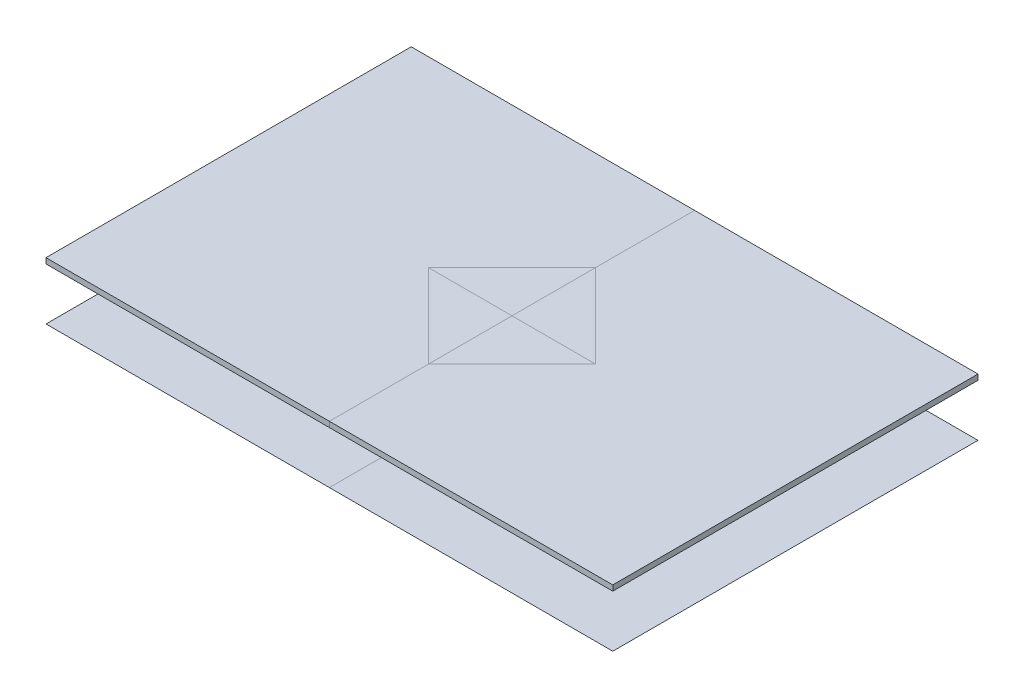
ISO-10303-21;
HEADER;
FILE_DESCRIPTION(('STEP AP214'),'2;1');
FILE_NAME('part.step','',(''),(''),'','','');
FILE_SCHEMA(('AUTOMOTIVE_DESIGN { 1 0 10303 214 1 1 1 1 }'));
ENDSEC;
DATA;
#1=APPLICATION_CONTEXT('core data for automotive mechanical design processes');
#2=APPLICATION_PROTOCOL_DEFINITION('international standard','automotive_design',2000,#1);
#3=PRODUCT_CONTEXT('',#1,'mechanical');
#4=PRODUCT('Part','Part','',(#3));
#5=PRODUCT_RELATED_PRODUCT_CATEGORY('part','',(#4));
#6=PRODUCT_DEFINITION_FORMATION('','',#4);
#7=PRODUCT_DEFINITION_CONTEXT('part definition',#1,'design');
#8=PRODUCT_DEFINITION('design','',#6,#7);
#9=PRODUCT_DEFINITION_SHAPE('','',#8);
#10=(LENGTH_UNIT() NAMED_UNIT(*) SI_UNIT(.MILLI.,.METRE.));
#11=(NAMED_UNIT(*) PLANE_ANGLE_UNIT() SI_UNIT($,.RADIAN.));
#12=(NAMED_UNIT(*) SI_UNIT($,.STERADIAN.) SOLID_ANGLE_UNIT());
#13=UNCERTAINTY_MEASURE_WITH_UNIT(LENGTH_MEASURE(1.E-05),#10,'distance_accuracy_value','');
#14=(GEOMETRIC_REPRESENTATION_CONTEXT(3) GLOBAL_UNCERTAINTY_ASSIGNED_CONTEXT((#13)) GLOBAL_UNIT_ASSIGNED_CONTEXT((#10,
#11,#12)) REPRESENTATION_CONTEXT('',''));
#15=CARTESIAN_POINT('',(0.,0.,0.));
#16=DIRECTION('',(0.,0.,1.));
#17=DIRECTION('',(1.,0.,0.));
#18=AXIS2_PLACEMENT_3D('',#15,#16,#17);
#19=CARTESIAN_POINT('',(0.,10.,0.));
#20=DIRECTION('',(-1.,0.,0.));
#21=DIRECTION('',(0.,0.,1.));
#22=AXIS2_PLACEMENT_3D('',#19,#20,#21);
#23=PLANE('',#22);
#24=DIRECTION('',(0.,1.,0.));
#25=VECTOR('',#24,1.);
#26=CARTESIAN_POINT('',(0.,10.,-15.2356445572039));
#27=LINE('',#26,#25);
#28=CARTESIAN_POINT('',(0.,9.5,-15.2356445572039));
#29=VERTEX_POINT('',#28);
#30=CARTESIAN_POINT('',(0.,10.5,-15.2356445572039));
#31=VERTEX_POINT('',#30);
#32=EDGE_CURVE('E12',#29,#31,#27,.T.);
#33=ORIENTED_EDGE('',*,*,#32,.F.);
#34=DIRECTION('',(0.,0.,1.));
#35=VECTOR('',#34,1.);
#36=CARTESIAN_POINT('',(0.,9.5,0.));
#37=LINE('',#36,#35);
#38=CARTESIAN_POINT('',(0.,9.5,-33.382140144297));
#39=VERTEX_POINT('',#38);
#40=EDGE_CURVE('E119',#29,#39,#37,.F.);
#41=ORIENTED_EDGE('',*,*,#40,.T.);
#42=DIRECTION('',(0.,1.,0.));
#43=VECTOR('',#42,1.);
#44=CARTESIAN_POINT('',(0.,10.,-33.382140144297));
#45=LINE('',#44,#43);
#46=CARTESIAN_POINT('',(0.,10.5,-33.382140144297));
#47=VERTEX_POINT('',#46);
#48=EDGE_CURVE('E55',#39,#47,#45,.T.);
#49=ORIENTED_EDGE('',*,*,#48,.T.);
#50=DIRECTION('',(0.,0.,1.));
#51=VECTOR('',#50,1.);
#52=CARTESIAN_POINT('',(0.,10.5,0.));
#53=LINE('',#52,#51);
#54=EDGE_CURVE('E147',#31,#47,#53,.F.);
#55=ORIENTED_EDGE('',*,*,#54,.F.);
#56=EDGE_LOOP('',(#33,#41,#49,#55));
#57=FACE_BOUND('',#56,.T.);
#58=ADVANCED_FACE('F45',(#57),#23,.F.);
#59=CARTESIAN_POINT('',(0.,10.,-33.382140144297));
#60=DIRECTION('',(0.,0.,1.));
#61=DIRECTION('',(1.,0.,0.));
#62=AXIS2_PLACEMENT_3D('',#59,#60,#61);
#63=PLANE('',#62);
#64=ORIENTED_EDGE('',*,*,#48,.F.);
#65=DIRECTION('',(1.,0.,0.));
#66=VECTOR('',#65,1.);
#67=CARTESIAN_POINT('',(0.,9.5,-33.382140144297));
#68=LINE('',#67,#66);
#69=CARTESIAN_POINT('',(-51.8038208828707,9.5,-33.382140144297));
#70=VERTEX_POINT('',#69);
#71=EDGE_CURVE('E135',#39,#70,#68,.F.);
#72=ORIENTED_EDGE('',*,*,#71,.T.);
#73=DIRECTION('',(0.,1.,0.));
#74=VECTOR('',#73,1.);
#75=CARTESIAN_POINT('',(-51.8038208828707,10.,-33.382140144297));
#76=LINE('',#75,#74);
#77=CARTESIAN_POINT('',(-51.8038208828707,10.5,-33.382140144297));
#78=VERTEX_POINT('',#77);
#79=EDGE_CURVE('E144',#70,#78,#76,.T.);
#80=ORIENTED_EDGE('',*,*,#79,.T.);
#81=DIRECTION('',(1.,0.,0.));
#82=VECTOR('',#81,1.);
#83=CARTESIAN_POINT('',(0.,10.5,-33.382140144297));
#84=LINE('',#83,#82);
#85=EDGE_CURVE('E154',#47,#78,#84,.F.);
#86=ORIENTED_EDGE('',*,*,#85,.F.);
#87=EDGE_LOOP('',(#64,#72,#80,#86));
#88=FACE_BOUND('',#87,.T.);
#89=ADVANCED_FACE('F156',(#88),#63,.F.);
#90=CARTESIAN_POINT('',(-51.8038208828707,10.,0.));
#91=DIRECTION('',(-1.,0.,0.));
#92=DIRECTION('',(0.,0.,1.));
#93=AXIS2_PLACEMENT_3D('',#90,#91,#92);
#94=PLANE('',#93);
#95=ORIENTED_EDGE('',*,*,#79,.F.);
#96=DIRECTION('',(0.,0.,1.));
#97=VECTOR('',#96,1.);
#98=CARTESIAN_POINT('',(-51.8038208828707,9.5,0.));
#99=LINE('',#98,#97);
#100=CARTESIAN_POINT('',(-51.8038208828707,9.5,33.382140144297));
#101=VERTEX_POINT('',#100);
#102=EDGE_CURVE('E132',#70,#101,#99,.T.);
#103=ORIENTED_EDGE('',*,*,#102,.T.);
#104=DIRECTION('',(0.,1.,0.));
#105=VECTOR('',#104,1.);
#106=CARTESIAN_POINT('',(-51.8038208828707,10.,33.382140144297));
#107=LINE('',#106,#105);
#108=CARTESIAN_POINT('',(-51.8038208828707,10.5,33.382140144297));
#109=VERTEX_POINT('',#108);
#110=EDGE_CURVE('E142',#101,#109,#107,.T.);
#111=ORIENTED_EDGE('',*,*,#110,.T.);
#112=DIRECTION('',(0.,0.,1.));
#113=VECTOR('',#112,1.);
#114=CARTESIAN_POINT('',(-51.8038208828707,10.5,0.));
#115=LINE('',#114,#113);
#116=EDGE_CURVE('E157',#78,#109,#115,.T.);
#117=ORIENTED_EDGE('',*,*,#116,.F.);
#118=EDGE_LOOP('',(#95,#103,#111,#117));
#119=FACE_BOUND('',#118,.T.);
#120=ADVANCED_FACE('F173',(#119),#94,.T.);
#121=CARTESIAN_POINT('',(0.,10.,33.382140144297));
#122=DIRECTION('',(0.,0.,1.));
#123=DIRECTION('',(1.,0.,0.));
#124=AXIS2_PLACEMENT_3D('',#121,#122,#123);
#125=PLANE('',#124);
#126=ORIENTED_EDGE('',*,*,#110,.F.);
#127=DIRECTION('',(1.,0.,0.));
#128=VECTOR('',#127,1.);
#129=CARTESIAN_POINT('',(0.,9.5,33.382140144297));
#130=LINE('',#129,#128);
#131=CARTESIAN_POINT('',(0.,9.5,33.382140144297));
#132=VERTEX_POINT('',#131);
#133=EDGE_CURVE('E129',#101,#132,#130,.T.);
#134=ORIENTED_EDGE('',*,*,#133,.T.);
#135=DIRECTION('',(0.,1.,0.));
#136=VECTOR('',#135,1.);
#137=CARTESIAN_POINT('',(0.,10.,33.382140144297));
#138=LINE('',#137,#136);
#139=CARTESIAN_POINT('',(0.,10.5,33.382140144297));
#140=VERTEX_POINT('',#139);
#141=EDGE_CURVE('E140',#132,#140,#138,.T.);
#142=ORIENTED_EDGE('',*,*,#141,.T.);
#143=DIRECTION('',(1.,0.,0.));
#144=VECTOR('',#143,1.);
#145=CARTESIAN_POINT('',(0.,10.5,33.382140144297));
#146=LINE('',#145,#144);
#147=EDGE_CURVE('E159',#109,#140,#146,.T.);
#148=ORIENTED_EDGE('',*,*,#147,.F.);
#149=EDGE_LOOP('',(#126,#134,#142,#148));
#150=FACE_BOUND('',#149,.T.);
#151=ADVANCED_FACE('F170',(#150),#125,.T.);
#152=CARTESIAN_POINT('',(0.,10.,0.));
#153=DIRECTION('',(-1.,0.,0.));
#154=DIRECTION('',(0.,0.,1.));
#155=AXIS2_PLACEMENT_3D('',#152,#153,#154);
#156=PLANE('',#155);
#157=ORIENTED_EDGE('',*,*,#141,.F.);
#158=DIRECTION('',(0.,0.,1.));
#159=VECTOR('',#158,1.);
#160=CARTESIAN_POINT('',(0.,9.5,0.));
#161=LINE('',#160,#159);
#162=CARTESIAN_POINT('',(0.,9.5,15.2356445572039));
#163=VERTEX_POINT('',#162);
#164=EDGE_CURVE('E126',#132,#163,#161,.F.);
#165=ORIENTED_EDGE('',*,*,#164,.T.);
#166=DIRECTION('',(0.,1.,0.));
#167=VECTOR('',#166,1.);
#168=CARTESIAN_POINT('',(0.,10.,15.2356445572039));
#169=LINE('',#168,#167);
#170=CARTESIAN_POINT('',(0.,10.5,15.2356445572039));
#171=VERTEX_POINT('',#170);
#172=EDGE_CURVE('E63',#163,#171,#169,.T.);
#173=ORIENTED_EDGE('',*,*,#172,.T.);
#174=DIRECTION('',(0.,0.,1.));
#175=VECTOR('',#174,1.);
#176=CARTESIAN_POINT('',(0.,10.5,0.));
#177=LINE('',#176,#175);
#178=EDGE_CURVE('E112',#140,#171,#177,.F.);
#179=ORIENTED_EDGE('',*,*,#178,.F.);
#180=EDGE_LOOP('',(#157,#165,#173,#179));
#181=FACE_BOUND('',#180,.T.);
#182=ADVANCED_FACE('F167',(#181),#156,.F.);
#183=CARTESIAN_POINT('',(-7.61782227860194,10.,7.61782227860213));
#184=DIRECTION('',(0.707106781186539,0.,-0.707106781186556));
#185=DIRECTION('',(-0.707106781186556,0.,-0.707106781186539));
#186=AXIS2_PLACEMENT_3D('',#183,#184,#185);
#187=PLANE('',#186);
#188=ORIENTED_EDGE('',*,*,#172,.F.);
#189=DIRECTION('',(-0.707106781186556,0.,-0.707106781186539));
#190=VECTOR('',#189,1.);
#191=CARTESIAN_POINT('',(-7.61782227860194,9.5,7.61782227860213));
#192=LINE('',#191,#190);
#193=CARTESIAN_POINT('',(-15.2356445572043,9.5,0.));
#194=VERTEX_POINT('',#193);
#195=EDGE_CURVE('E117',#163,#194,#192,.T.);
#196=ORIENTED_EDGE('',*,*,#195,.T.);
#197=DIRECTION('',(0.,1.,0.));
#198=VECTOR('',#197,1.);
#199=CARTESIAN_POINT('',(-15.2356445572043,10.,0.));
#200=LINE('',#199,#198);
#201=CARTESIAN_POINT('',(-15.2356445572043,10.5,0.));
#202=VERTEX_POINT('',#201);
#203=EDGE_CURVE('E49',#194,#202,#200,.T.);
#204=ORIENTED_EDGE('',*,*,#203,.T.);
#205=DIRECTION('',(-0.707106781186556,0.,-0.707106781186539));
#206=VECTOR('',#205,1.);
#207=CARTESIAN_POINT('',(-7.61782227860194,10.5,7.61782227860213));
#208=LINE('',#207,#206);
#209=EDGE_CURVE('E128',#171,#202,#208,.T.);
#210=ORIENTED_EDGE('',*,*,#209,.F.);
#211=EDGE_LOOP('',(#188,#196,#204,#210));
#212=FACE_BOUND('',#211,.T.);
#213=ADVANCED_FACE('F121',(#212),#187,.T.);
#214=CARTESIAN_POINT('',(-7.61782227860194,10.,-7.61782227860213));
#215=DIRECTION('',(0.707106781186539,0.,0.707106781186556));
#216=DIRECTION('',(0.707106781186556,0.,-0.707106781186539));
#217=AXIS2_PLACEMENT_3D('',#214,#215,#216);
#218=PLANE('',#217);
#219=DIRECTION('',(0.707106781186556,0.,-0.707106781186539));
#220=VECTOR('',#219,1.);
#221=CARTESIAN_POINT('',(-7.61782227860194,9.5,-7.61782227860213));
#222=LINE('',#221,#220);
#223=EDGE_CURVE('E106',#194,#29,#222,.T.);
#224=ORIENTED_EDGE('',*,*,#223,.T.);
#225=ORIENTED_EDGE('',*,*,#32,.T.);
#226=DIRECTION('',(0.707106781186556,0.,-0.707106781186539));
#227=VECTOR('',#226,1.);
#228=CARTESIAN_POINT('',(-7.61782227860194,10.5,-7.61782227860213));
#229=LINE('',#228,#227);
#230=EDGE_CURVE('E108',#202,#31,#229,.T.);
#231=ORIENTED_EDGE('',*,*,#230,.F.);
#232=ORIENTED_EDGE('',*,*,#203,.F.);
#233=EDGE_LOOP('',(#224,#225,#231,#232));
#234=FACE_BOUND('',#233,.T.);
#235=ADVANCED_FACE('F47',(#234),#218,.T.);
#236=CARTESIAN_POINT('',(0.,10.5,0.));
#237=DIRECTION('',(0.,1.,0.));
#238=DIRECTION('',(0.,0.,1.));
#239=AXIS2_PLACEMENT_3D('',#236,#237,#238);
#240=PLANE('',#239);
#241=ORIENTED_EDGE('',*,*,#209,.T.);
#242=ORIENTED_EDGE('',*,*,#230,.T.);
#243=ORIENTED_EDGE('',*,*,#54,.T.);
#244=ORIENTED_EDGE('',*,*,#85,.T.);
#245=ORIENTED_EDGE('',*,*,#116,.T.);
#246=ORIENTED_EDGE('',*,*,#147,.T.);
#247=ORIENTED_EDGE('',*,*,#178,.T.);
#248=EDGE_LOOP('',(#241,#242,#243,#244,#245,#246,#247));
#249=FACE_BOUND('',#248,.T.);
#250=ADVANCED_FACE('F152',(#249),#240,.T.);
#251=CARTESIAN_POINT('',(0.,9.5,0.));
#252=DIRECTION('',(0.,1.,0.));
#253=DIRECTION('',(0.,0.,1.));
#254=AXIS2_PLACEMENT_3D('',#251,#252,#253);
#255=PLANE('',#254);
#256=ORIENTED_EDGE('',*,*,#195,.F.);
#257=ORIENTED_EDGE('',*,*,#164,.F.);
#258=ORIENTED_EDGE('',*,*,#133,.F.);
#259=ORIENTED_EDGE('',*,*,#102,.F.);
#260=ORIENTED_EDGE('',*,*,#71,.F.);
#261=ORIENTED_EDGE('',*,*,#40,.F.);
#262=ORIENTED_EDGE('',*,*,#223,.F.);
#263=EDGE_LOOP('',(#256,#257,#258,#259,#260,#261,#262));
#264=FACE_BOUND('',#263,.T.);
#265=ADVANCED_FACE('F115',(#264),#255,.F.);
#266=CLOSED_SHELL('',(#58,#89,#120,#151,#182,#213,#235,#250,#265));
#267=MANIFOLD_SOLID_BREP('B2',#266);
#268=CARTESIAN_POINT('',(-7.61782227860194,10.,7.61782227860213));
#269=DIRECTION('',(0.707106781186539,0.,-0.707106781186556));
#270=DIRECTION('',(-0.707106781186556,0.,-0.707106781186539));
#271=AXIS2_PLACEMENT_3D('',#268,#269,#270);
#272=PLANE('',#271);
#273=DIRECTION('',(0.,1.,0.));
#274=VECTOR('',#273,1.);
#275=CARTESIAN_POINT('',(-15.2356445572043,10.,0.));
#276=LINE('',#275,#274);
#277=CARTESIAN_POINT('',(-15.2356445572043,9.5,0.));
#278=VERTEX_POINT('',#277);
#279=CARTESIAN_POINT('',(-15.2356445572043,10.5,0.));
#280=VERTEX_POINT('',#279);
#281=EDGE_CURVE('E43',#278,#280,#276,.T.);
#282=ORIENTED_EDGE('',*,*,#281,.F.);
#283=DIRECTION('',(-0.707106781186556,0.,-0.707106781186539));
#284=VECTOR('',#283,1.);
#285=CARTESIAN_POINT('',(-7.61782227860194,9.5,7.61782227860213));
#286=LINE('',#285,#284);
#287=CARTESIAN_POINT('',(0.,9.5,15.2356445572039));
#288=VERTEX_POINT('',#287);
#289=EDGE_CURVE('E300',#288,#278,#286,.T.);
#290=ORIENTED_EDGE('',*,*,#289,.F.);
#291=DIRECTION('',(0.,1.,0.));
#292=VECTOR('',#291,1.);
#293=CARTESIAN_POINT('',(0.,10.,15.2356445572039));
#294=LINE('',#293,#292);
#295=CARTESIAN_POINT('',(0.,10.5,15.2356445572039));
#296=VERTEX_POINT('',#295);
#297=EDGE_CURVE('E266',#288,#296,#294,.T.);
#298=ORIENTED_EDGE('',*,*,#297,.T.);
#299=DIRECTION('',(-0.707106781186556,0.,-0.707106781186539));
#300=VECTOR('',#299,1.);
#301=CARTESIAN_POINT('',(-7.61782227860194,10.5,7.61782227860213));
#302=LINE('',#301,#300);
#303=EDGE_CURVE('E295',#296,#280,#302,.T.);
#304=ORIENTED_EDGE('',*,*,#303,.T.);
#305=EDGE_LOOP('',(#282,#290,#298,#304));
#306=FACE_BOUND('',#305,.T.);
#307=ADVANCED_FACE('F256',(#306),#272,.F.);
#308=CARTESIAN_POINT('',(0.,10.,0.));
#309=DIRECTION('',(-1.,0.,0.));
#310=DIRECTION('',(0.,0.,1.));
#311=AXIS2_PLACEMENT_3D('',#308,#309,#310);
#312=PLANE('',#311);
#313=ORIENTED_EDGE('',*,*,#297,.F.);
#314=DIRECTION('',(0.,0.,1.));
#315=VECTOR('',#314,1.);
#316=CARTESIAN_POINT('',(0.,9.5,0.));
#317=LINE('',#316,#315);
#318=CARTESIAN_POINT('',(0.,9.5,0.));
#319=VERTEX_POINT('',#318);
#320=EDGE_CURVE('E299',#288,#319,#317,.F.);
#321=ORIENTED_EDGE('',*,*,#320,.T.);
#322=DIRECTION('',(0.,1.,0.));
#323=VECTOR('',#322,1.);
#324=CARTESIAN_POINT('',(0.,10.,0.));
#325=LINE('',#324,#323);
#326=CARTESIAN_POINT('',(0.,10.5,0.));
#327=VERTEX_POINT('',#326);
#328=EDGE_CURVE('E260',#319,#327,#325,.T.);
#329=ORIENTED_EDGE('',*,*,#328,.T.);
#330=DIRECTION('',(0.,0.,1.));
#331=VECTOR('',#330,1.);
#332=CARTESIAN_POINT('',(0.,10.5,0.));
#333=LINE('',#332,#331);
#334=EDGE_CURVE('E307',#296,#327,#333,.F.);
#335=ORIENTED_EDGE('',*,*,#334,.F.);
#336=EDGE_LOOP('',(#313,#321,#329,#335));
#337=FACE_BOUND('',#336,.T.);
#338=ADVANCED_FACE('F302',(#337),#312,.F.);
#339=CARTESIAN_POINT('',(0.,10.,0.));
#340=DIRECTION('',(0.,0.,1.));
#341=DIRECTION('',(1.,0.,0.));
#342=AXIS2_PLACEMENT_3D('',#339,#340,#341);
#343=PLANE('',#342);
#344=DIRECTION('',(1.,0.,0.));
#345=VECTOR('',#344,1.);
#346=CARTESIAN_POINT('',(0.,9.5,0.));
#347=LINE('',#346,#345);
#348=EDGE_CURVE('E288',#319,#278,#347,.F.);
#349=ORIENTED_EDGE('',*,*,#348,.T.);
#350=ORIENTED_EDGE('',*,*,#281,.T.);
#351=DIRECTION('',(1.,0.,0.));
#352=VECTOR('',#351,1.);
#353=CARTESIAN_POINT('',(0.,10.5,0.));
#354=LINE('',#353,#352);
#355=EDGE_CURVE('E291',#327,#280,#354,.F.);
#356=ORIENTED_EDGE('',*,*,#355,.F.);
#357=ORIENTED_EDGE('',*,*,#328,.F.);
#358=EDGE_LOOP('',(#349,#350,#356,#357));
#359=FACE_BOUND('',#358,.T.);
#360=ADVANCED_FACE('F258',(#359),#343,.F.);
#361=CARTESIAN_POINT('',(0.,10.5,0.));
#362=DIRECTION('',(0.,1.,0.));
#363=DIRECTION('',(0.,0.,1.));
#364=AXIS2_PLACEMENT_3D('',#361,#362,#363);
#365=PLANE('',#364);
#366=ORIENTED_EDGE('',*,*,#334,.T.);
#367=ORIENTED_EDGE('',*,*,#355,.T.);
#368=ORIENTED_EDGE('',*,*,#303,.F.);
#369=EDGE_LOOP('',(#366,#367,#368));
#370=FACE_BOUND('',#369,.T.);
#371=ADVANCED_FACE('F312',(#370),#365,.T.);
#372=CARTESIAN_POINT('',(0.,9.5,0.));
#373=DIRECTION('',(0.,1.,0.));
#374=DIRECTION('',(0.,0.,1.));
#375=AXIS2_PLACEMENT_3D('',#372,#373,#374);
#376=PLANE('',#375);
#377=ORIENTED_EDGE('',*,*,#320,.F.);
#378=ORIENTED_EDGE('',*,*,#289,.T.);
#379=ORIENTED_EDGE('',*,*,#348,.F.);
#380=EDGE_LOOP('',(#377,#378,#379));
#381=FACE_BOUND('',#380,.T.);
#382=ADVANCED_FACE('F298',(#381),#376,.F.);
#383=CLOSED_SHELL('',(#307,#338,#360,#371,#382));
#384=MANIFOLD_SOLID_BREP('B6',#383);
#385=CARTESIAN_POINT('',(0.,10.,0.));
#386=DIRECTION('',(-1.,0.,0.));
#387=DIRECTION('',(0.,0.,1.));
#388=AXIS2_PLACEMENT_3D('',#385,#386,#387);
#389=PLANE('',#388);
#390=DIRECTION('',(0.,1.,0.));
#391=VECTOR('',#390,1.);
#392=CARTESIAN_POINT('',(0.,10.,15.2356445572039));
#393=LINE('',#392,#391);
#394=CARTESIAN_POINT('',(0.,9.5,15.2356445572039));
#395=VERTEX_POINT('',#394);
#396=CARTESIAN_POINT('',(0.,10.5,15.2356445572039));
#397=VERTEX_POINT('',#396);
#398=EDGE_CURVE('E254',#395,#397,#393,.T.);
#399=ORIENTED_EDGE('',*,*,#398,.F.);
#400=DIRECTION('',(0.,0.,1.));
#401=VECTOR('',#400,1.);
#402=CARTESIAN_POINT('',(0.,9.5,0.));
#403=LINE('',#402,#401);
#404=CARTESIAN_POINT('',(0.,9.5,33.382140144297));
#405=VERTEX_POINT('',#404);
#406=EDGE_CURVE('E437',#405,#395,#403,.F.);
#407=ORIENTED_EDGE('',*,*,#406,.F.);
#408=DIRECTION('',(0.,1.,0.));
#409=VECTOR('',#408,1.);
#410=CARTESIAN_POINT('',(0.,10.,33.382140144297));
#411=LINE('',#410,#409);
#412=CARTESIAN_POINT('',(0.,10.5,33.382140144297));
#413=VERTEX_POINT('',#412);
#414=EDGE_CURVE('E373',#405,#413,#411,.T.);
#415=ORIENTED_EDGE('',*,*,#414,.T.);
#416=DIRECTION('',(0.,0.,1.));
#417=VECTOR('',#416,1.);
#418=CARTESIAN_POINT('',(0.,10.5,0.));
#419=LINE('',#418,#417);
#420=EDGE_CURVE('E465',#413,#397,#419,.F.);
#421=ORIENTED_EDGE('',*,*,#420,.T.);
#422=EDGE_LOOP('',(#399,#407,#415,#421));
#423=FACE_BOUND('',#422,.T.);
#424=ADVANCED_FACE('F363',(#423),#389,.T.);
#425=CARTESIAN_POINT('',(0.,10.,33.382140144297));
#426=DIRECTION('',(0.,0.,1.));
#427=DIRECTION('',(1.,0.,0.));
#428=AXIS2_PLACEMENT_3D('',#425,#426,#427);
#429=PLANE('',#428);
#430=ORIENTED_EDGE('',*,*,#414,.F.);
#431=DIRECTION('',(1.,0.,0.));
#432=VECTOR('',#431,1.);
#433=CARTESIAN_POINT('',(0.,9.5,33.382140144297));
#434=LINE('',#433,#432);
#435=CARTESIAN_POINT('',(51.8038208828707,9.5,33.382140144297));
#436=VERTEX_POINT('',#435);
#437=EDGE_CURVE('E453',#405,#436,#434,.T.);
#438=ORIENTED_EDGE('',*,*,#437,.T.);
#439=DIRECTION('',(0.,1.,0.));
#440=VECTOR('',#439,1.);
#441=CARTESIAN_POINT('',(51.8038208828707,10.,33.382140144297));
#442=LINE('',#441,#440);
#443=CARTESIAN_POINT('',(51.8038208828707,10.5,33.382140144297));
#444=VERTEX_POINT('',#443);
#445=EDGE_CURVE('E462',#436,#444,#442,.T.);
#446=ORIENTED_EDGE('',*,*,#445,.T.);
#447=DIRECTION('',(1.,0.,0.));
#448=VECTOR('',#447,1.);
#449=CARTESIAN_POINT('',(0.,10.5,33.382140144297));
#450=LINE('',#449,#448);
#451=EDGE_CURVE('E472',#413,#444,#450,.T.);
#452=ORIENTED_EDGE('',*,*,#451,.F.);
#453=EDGE_LOOP('',(#430,#438,#446,#452));
#454=FACE_BOUND('',#453,.T.);
#455=ADVANCED_FACE('F474',(#454),#429,.T.);
#456=CARTESIAN_POINT('',(51.8038208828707,10.,0.));
#457=DIRECTION('',(-1.,0.,0.));
#458=DIRECTION('',(0.,0.,1.));
#459=AXIS2_PLACEMENT_3D('',#456,#457,#458);
#460=PLANE('',#459);
#461=ORIENTED_EDGE('',*,*,#445,.F.);
#462=DIRECTION('',(0.,0.,1.));
#463=VECTOR('',#462,1.);
#464=CARTESIAN_POINT('',(51.8038208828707,9.5,0.));
#465=LINE('',#464,#463);
#466=CARTESIAN_POINT('',(51.8038208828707,9.5,-33.382140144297));
#467=VERTEX_POINT('',#466);
#468=EDGE_CURVE('E450',#436,#467,#465,.F.);
#469=ORIENTED_EDGE('',*,*,#468,.T.);
#470=DIRECTION('',(0.,1.,0.));
#471=VECTOR('',#470,1.);
#472=CARTESIAN_POINT('',(51.8038208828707,10.,-33.382140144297));
#473=LINE('',#472,#471);
#474=CARTESIAN_POINT('',(51.8038208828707,10.5,-33.382140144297));
#475=VERTEX_POINT('',#474);
#476=EDGE_CURVE('E460',#467,#475,#473,.T.);
#477=ORIENTED_EDGE('',*,*,#476,.T.);
#478=DIRECTION('',(0.,0.,1.));
#479=VECTOR('',#478,1.);
#480=CARTESIAN_POINT('',(51.8038208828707,10.5,0.));
#481=LINE('',#480,#479);
#482=EDGE_CURVE('E475',#444,#475,#481,.F.);
#483=ORIENTED_EDGE('',*,*,#482,.F.);
#484=EDGE_LOOP('',(#461,#469,#477,#483));
#485=FACE_BOUND('',#484,.T.);
#486=ADVANCED_FACE('F491',(#485),#460,.F.);
#487=CARTESIAN_POINT('',(0.,10.,-33.382140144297));
#488=DIRECTION('',(0.,0.,1.));
#489=DIRECTION('',(1.,0.,0.));
#490=AXIS2_PLACEMENT_3D('',#487,#488,#489);
#491=PLANE('',#490);
#492=ORIENTED_EDGE('',*,*,#476,.F.);
#493=DIRECTION('',(1.,0.,0.));
#494=VECTOR('',#493,1.);
#495=CARTESIAN_POINT('',(0.,9.5,-33.382140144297));
#496=LINE('',#495,#494);
#497=CARTESIAN_POINT('',(0.,9.5,-33.382140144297));
#498=VERTEX_POINT('',#497);
#499=EDGE_CURVE('E447',#467,#498,#496,.F.);
#500=ORIENTED_EDGE('',*,*,#499,.T.);
#501=DIRECTION('',(0.,1.,0.));
#502=VECTOR('',#501,1.);
#503=CARTESIAN_POINT('',(0.,10.,-33.382140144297));
#504=LINE('',#503,#502);
#505=CARTESIAN_POINT('',(0.,10.5,-33.382140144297));
#506=VERTEX_POINT('',#505);
#507=EDGE_CURVE('E458',#498,#506,#504,.T.);
#508=ORIENTED_EDGE('',*,*,#507,.T.);
#509=DIRECTION('',(1.,0.,0.));
#510=VECTOR('',#509,1.);
#511=CARTESIAN_POINT('',(0.,10.5,-33.382140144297));
#512=LINE('',#511,#510);
#513=EDGE_CURVE('E477',#475,#506,#512,.F.);
#514=ORIENTED_EDGE('',*,*,#513,.F.);
#515=EDGE_LOOP('',(#492,#500,#508,#514));
#516=FACE_BOUND('',#515,.T.);
#517=ADVANCED_FACE('F488',(#516),#491,.F.);
#518=CARTESIAN_POINT('',(0.,10.,0.));
#519=DIRECTION('',(-1.,0.,0.));
#520=DIRECTION('',(0.,0.,1.));
#521=AXIS2_PLACEMENT_3D('',#518,#519,#520);
#522=PLANE('',#521);
#523=ORIENTED_EDGE('',*,*,#507,.F.);
#524=DIRECTION('',(0.,0.,1.));
#525=VECTOR('',#524,1.);
#526=CARTESIAN_POINT('',(0.,9.5,0.));
#527=LINE('',#526,#525);
#528=CARTESIAN_POINT('',(0.,9.5,-15.2356445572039));
#529=VERTEX_POINT('',#528);
#530=EDGE_CURVE('E444',#529,#498,#527,.F.);
#531=ORIENTED_EDGE('',*,*,#530,.F.);
#532=DIRECTION('',(0.,1.,0.));
#533=VECTOR('',#532,1.);
#534=CARTESIAN_POINT('',(0.,10.,-15.2356445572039));
#535=LINE('',#534,#533);
#536=CARTESIAN_POINT('',(0.,10.5,-15.2356445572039));
#537=VERTEX_POINT('',#536);
#538=EDGE_CURVE('E381',#529,#537,#535,.T.);
#539=ORIENTED_EDGE('',*,*,#538,.T.);
#540=DIRECTION('',(0.,0.,1.));
#541=VECTOR('',#540,1.);
#542=CARTESIAN_POINT('',(0.,10.5,0.));
#543=LINE('',#542,#541);
#544=EDGE_CURVE('E430',#537,#506,#543,.F.);
#545=ORIENTED_EDGE('',*,*,#544,.T.);
#546=EDGE_LOOP('',(#523,#531,#539,#545));
#547=FACE_BOUND('',#546,.T.);
#548=ADVANCED_FACE('F485',(#547),#522,.T.);
#549=CARTESIAN_POINT('',(7.61782227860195,10.,-7.61782227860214));
#550=DIRECTION('',(-0.707106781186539,0.,0.707106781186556));
#551=DIRECTION('',(0.707106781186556,0.,0.707106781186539));
#552=AXIS2_PLACEMENT_3D('',#549,#550,#551);
#553=PLANE('',#552);
#554=ORIENTED_EDGE('',*,*,#538,.F.);
#555=DIRECTION('',(0.707106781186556,0.,0.707106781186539));
#556=VECTOR('',#555,1.);
#557=CARTESIAN_POINT('',(7.61782227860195,9.5,-7.61782227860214));
#558=LINE('',#557,#556);
#559=CARTESIAN_POINT('',(15.2356445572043,9.5,0.));
#560=VERTEX_POINT('',#559);
#561=EDGE_CURVE('E435',#529,#560,#558,.T.);
#562=ORIENTED_EDGE('',*,*,#561,.T.);
#563=DIRECTION('',(0.,1.,0.));
#564=VECTOR('',#563,1.);
#565=CARTESIAN_POINT('',(15.2356445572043,10.,0.));
#566=LINE('',#565,#564);
#567=CARTESIAN_POINT('',(15.2356445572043,10.5,0.));
#568=VERTEX_POINT('',#567);
#569=EDGE_CURVE('E367',#560,#568,#566,.T.);
#570=ORIENTED_EDGE('',*,*,#569,.T.);
#571=DIRECTION('',(0.707106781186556,0.,0.707106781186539));
#572=VECTOR('',#571,1.);
#573=CARTESIAN_POINT('',(7.61782227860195,10.5,-7.61782227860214));
#574=LINE('',#573,#572);
#575=EDGE_CURVE('E446',#537,#568,#574,.T.);
#576=ORIENTED_EDGE('',*,*,#575,.F.);
#577=EDGE_LOOP('',(#554,#562,#570,#576));
#578=FACE_BOUND('',#577,.T.);
#579=ADVANCED_FACE('F439',(#578),#553,.T.);
#580=CARTESIAN_POINT('',(7.61782227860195,10.,7.61782227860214));
#581=DIRECTION('',(-0.707106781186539,0.,-0.707106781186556));
#582=DIRECTION('',(-0.707106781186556,0.,0.707106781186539));
#583=AXIS2_PLACEMENT_3D('',#580,#581,#582);
#584=PLANE('',#583);
#585=DIRECTION('',(-0.707106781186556,0.,0.707106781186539));
#586=VECTOR('',#585,1.);
#587=CARTESIAN_POINT('',(7.61782227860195,9.5,7.61782227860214));
#588=LINE('',#587,#586);
#589=EDGE_CURVE('E424',#560,#395,#588,.T.);
#590=ORIENTED_EDGE('',*,*,#589,.T.);
#591=ORIENTED_EDGE('',*,*,#398,.T.);
#592=DIRECTION('',(-0.707106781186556,0.,0.707106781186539));
#593=VECTOR('',#592,1.);
#594=CARTESIAN_POINT('',(7.61782227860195,10.5,7.61782227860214));
#595=LINE('',#594,#593);
#596=EDGE_CURVE('E426',#568,#397,#595,.T.);
#597=ORIENTED_EDGE('',*,*,#596,.F.);
#598=ORIENTED_EDGE('',*,*,#569,.F.);
#599=EDGE_LOOP('',(#590,#591,#597,#598));
#600=FACE_BOUND('',#599,.T.);
#601=ADVANCED_FACE('F365',(#600),#584,.T.);
#602=CARTESIAN_POINT('',(0.,10.5,0.));
#603=DIRECTION('',(0.,1.,0.));
#604=DIRECTION('',(0.,0.,1.));
#605=AXIS2_PLACEMENT_3D('',#602,#603,#604);
#606=PLANE('',#605);
#607=ORIENTED_EDGE('',*,*,#575,.T.);
#608=ORIENTED_EDGE('',*,*,#596,.T.);
#609=ORIENTED_EDGE('',*,*,#420,.F.);
#610=ORIENTED_EDGE('',*,*,#451,.T.);
#611=ORIENTED_EDGE('',*,*,#482,.T.);
#612=ORIENTED_EDGE('',*,*,#513,.T.);
#613=ORIENTED_EDGE('',*,*,#544,.F.);
#614=EDGE_LOOP('',(#607,#608,#609,#610,#611,#612,#613));
#615=FACE_BOUND('',#614,.T.);
#616=ADVANCED_FACE('F470',(#615),#606,.T.);
#617=CARTESIAN_POINT('',(0.,9.5,0.));
#618=DIRECTION('',(0.,1.,0.));
#619=DIRECTION('',(0.,0.,1.));
#620=AXIS2_PLACEMENT_3D('',#617,#618,#619);
#621=PLANE('',#620);
#622=ORIENTED_EDGE('',*,*,#561,.F.);
#623=ORIENTED_EDGE('',*,*,#530,.T.);
#624=ORIENTED_EDGE('',*,*,#499,.F.);
#625=ORIENTED_EDGE('',*,*,#468,.F.);
#626=ORIENTED_EDGE('',*,*,#437,.F.);
#627=ORIENTED_EDGE('',*,*,#406,.T.);
#628=ORIENTED_EDGE('',*,*,#589,.F.);
#629=EDGE_LOOP('',(#622,#623,#624,#625,#626,#627,#628));
#630=FACE_BOUND('',#629,.T.);
#631=ADVANCED_FACE('F433',(#630),#621,.F.);
#632=CLOSED_SHELL('',(#424,#455,#486,#517,#548,#579,#601,#616,#631));
#633=MANIFOLD_SOLID_BREP('B37',#632);
#634=CARTESIAN_POINT('',(0.,10.,0.));
#635=DIRECTION('',(-1.,0.,0.));
#636=DIRECTION('',(0.,0.,1.));
#637=AXIS2_PLACEMENT_3D('',#634,#635,#636);
#638=PLANE('',#637);
#639=DIRECTION('',(0.,1.,0.));
#640=VECTOR('',#639,1.);
#641=CARTESIAN_POINT('',(0.,10.,0.));
#642=LINE('',#641,#640);
#643=CARTESIAN_POINT('',(0.,9.5,0.));
#644=VERTEX_POINT('',#643);
#645=CARTESIAN_POINT('',(0.,10.5,0.));
#646=VERTEX_POINT('',#645);
#647=EDGE_CURVE('E361',#644,#646,#642,.T.);
#648=ORIENTED_EDGE('',*,*,#647,.F.);
#649=DIRECTION('',(0.,0.,1.));
#650=VECTOR('',#649,1.);
#651=CARTESIAN_POINT('',(0.,9.5,0.));
#652=LINE('',#651,#650);
#653=CARTESIAN_POINT('',(0.,9.5,15.2356445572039));
#654=VERTEX_POINT('',#653);
#655=EDGE_CURVE('E618',#654,#644,#652,.F.);
#656=ORIENTED_EDGE('',*,*,#655,.F.);
#657=DIRECTION('',(0.,1.,0.));
#658=VECTOR('',#657,1.);
#659=CARTESIAN_POINT('',(0.,10.,15.2356445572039));
#660=LINE('',#659,#658);
#661=CARTESIAN_POINT('',(0.,10.5,15.2356445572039));
#662=VERTEX_POINT('',#661);
#663=EDGE_CURVE('E584',#654,#662,#660,.T.);
#664=ORIENTED_EDGE('',*,*,#663,.T.);
#665=DIRECTION('',(0.,0.,1.));
#666=VECTOR('',#665,1.);
#667=CARTESIAN_POINT('',(0.,10.5,0.));
#668=LINE('',#667,#666);
#669=EDGE_CURVE('E613',#662,#646,#668,.F.);
#670=ORIENTED_EDGE('',*,*,#669,.T.);
#671=EDGE_LOOP('',(#648,#656,#664,#670));
#672=FACE_BOUND('',#671,.T.);
#673=ADVANCED_FACE('F574',(#672),#638,.T.);
#674=CARTESIAN_POINT('',(7.61782227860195,10.,7.61782227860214));
#675=DIRECTION('',(-0.707106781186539,0.,-0.707106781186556));
#676=DIRECTION('',(-0.707106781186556,0.,0.707106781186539));
#677=AXIS2_PLACEMENT_3D('',#674,#675,#676);
#678=PLANE('',#677);
#679=ORIENTED_EDGE('',*,*,#663,.F.);
#680=DIRECTION('',(-0.707106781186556,0.,0.707106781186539));
#681=VECTOR('',#680,1.);
#682=CARTESIAN_POINT('',(7.61782227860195,9.5,7.61782227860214));
#683=LINE('',#682,#681);
#684=CARTESIAN_POINT('',(15.2356445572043,9.5,0.));
#685=VERTEX_POINT('',#684);
#686=EDGE_CURVE('E617',#685,#654,#683,.T.);
#687=ORIENTED_EDGE('',*,*,#686,.F.);
#688=DIRECTION('',(0.,1.,0.));
#689=VECTOR('',#688,1.);
#690=CARTESIAN_POINT('',(15.2356445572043,10.,0.));
#691=LINE('',#690,#689);
#692=CARTESIAN_POINT('',(15.2356445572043,10.5,0.));
#693=VERTEX_POINT('',#692);
#694=EDGE_CURVE('E578',#685,#693,#691,.T.);
#695=ORIENTED_EDGE('',*,*,#694,.T.);
#696=DIRECTION('',(-0.707106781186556,0.,0.707106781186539));
#697=VECTOR('',#696,1.);
#698=CARTESIAN_POINT('',(7.61782227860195,10.5,7.61782227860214));
#699=LINE('',#698,#697);
#700=EDGE_CURVE('E625',#693,#662,#699,.T.);
#701=ORIENTED_EDGE('',*,*,#700,.T.);
#702=EDGE_LOOP('',(#679,#687,#695,#701));
#703=FACE_BOUND('',#702,.T.);
#704=ADVANCED_FACE('F620',(#703),#678,.F.);
#705=CARTESIAN_POINT('',(0.,10.,0.));
#706=DIRECTION('',(0.,0.,1.));
#707=DIRECTION('',(1.,0.,0.));
#708=AXIS2_PLACEMENT_3D('',#705,#706,#707);
#709=PLANE('',#708);
#710=DIRECTION('',(1.,0.,0.));
#711=VECTOR('',#710,1.);
#712=CARTESIAN_POINT('',(0.,9.5,0.));
#713=LINE('',#712,#711);
#714=EDGE_CURVE('E606',#685,#644,#713,.F.);
#715=ORIENTED_EDGE('',*,*,#714,.T.);
#716=ORIENTED_EDGE('',*,*,#647,.T.);
#717=DIRECTION('',(1.,0.,0.));
#718=VECTOR('',#717,1.);
#719=CARTESIAN_POINT('',(0.,10.5,0.));
#720=LINE('',#719,#718);
#721=EDGE_CURVE('E609',#693,#646,#720,.F.);
#722=ORIENTED_EDGE('',*,*,#721,.F.);
#723=ORIENTED_EDGE('',*,*,#694,.F.);
#724=EDGE_LOOP('',(#715,#716,#722,#723));
#725=FACE_BOUND('',#724,.T.);
#726=ADVANCED_FACE('F576',(#725),#709,.F.);
#727=CARTESIAN_POINT('',(0.,10.5,0.));
#728=DIRECTION('',(0.,1.,0.));
#729=DIRECTION('',(0.,0.,1.));
#730=AXIS2_PLACEMENT_3D('',#727,#728,#729);
#731=PLANE('',#730);
#732=ORIENTED_EDGE('',*,*,#700,.F.);
#733=ORIENTED_EDGE('',*,*,#721,.T.);
#734=ORIENTED_EDGE('',*,*,#669,.F.);
#735=EDGE_LOOP('',(#732,#733,#734));
#736=FACE_BOUND('',#735,.T.);
#737=ADVANCED_FACE('F630',(#736),#731,.T.);
#738=CARTESIAN_POINT('',(0.,9.5,0.));
#739=DIRECTION('',(0.,1.,0.));
#740=DIRECTION('',(0.,0.,1.));
#741=AXIS2_PLACEMENT_3D('',#738,#739,#740);
#742=PLANE('',#741);
#743=ORIENTED_EDGE('',*,*,#686,.T.);
#744=ORIENTED_EDGE('',*,*,#655,.T.);
#745=ORIENTED_EDGE('',*,*,#714,.F.);
#746=EDGE_LOOP('',(#743,#744,#745));
#747=FACE_BOUND('',#746,.T.);
#748=ADVANCED_FACE('F616',(#747),#742,.F.);
#749=CLOSED_SHELL('',(#673,#704,#726,#737,#748));
#750=MANIFOLD_SOLID_BREP('B248',#749);
#751=CARTESIAN_POINT('',(0.,10.,0.));
#752=DIRECTION('',(-1.,0.,0.));
#753=DIRECTION('',(0.,0.,1.));
#754=AXIS2_PLACEMENT_3D('',#751,#752,#753);
#755=PLANE('',#754);
#756=DIRECTION('',(0.,1.,0.));
#757=VECTOR('',#756,1.);
#758=CARTESIAN_POINT('',(0.,10.,-15.2356445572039));
#759=LINE('',#758,#757);
#760=CARTESIAN_POINT('',(0.,9.5,-15.2356445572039));
#761=VERTEX_POINT('',#760);
#762=CARTESIAN_POINT('',(0.,10.5,-15.2356445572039));
#763=VERTEX_POINT('',#762);
#764=EDGE_CURVE('E572',#761,#763,#759,.T.);
#765=ORIENTED_EDGE('',*,*,#764,.F.);
#766=DIRECTION('',(0.,0.,1.));
#767=VECTOR('',#766,1.);
#768=CARTESIAN_POINT('',(0.,9.5,0.));
#769=LINE('',#768,#767);
#770=CARTESIAN_POINT('',(0.,9.5,0.));
#771=VERTEX_POINT('',#770);
#772=EDGE_CURVE('E725',#771,#761,#769,.F.);
#773=ORIENTED_EDGE('',*,*,#772,.F.);
#774=DIRECTION('',(0.,1.,0.));
#775=VECTOR('',#774,1.);
#776=CARTESIAN_POINT('',(0.,10.,0.));
#777=LINE('',#776,#775);
#778=CARTESIAN_POINT('',(0.,10.5,0.));
#779=VERTEX_POINT('',#778);
#780=EDGE_CURVE('E691',#771,#779,#777,.T.);
#781=ORIENTED_EDGE('',*,*,#780,.T.);
#782=DIRECTION('',(0.,0.,1.));
#783=VECTOR('',#782,1.);
#784=CARTESIAN_POINT('',(0.,10.5,0.));
#785=LINE('',#784,#783);
#786=EDGE_CURVE('E720',#779,#763,#785,.F.);
#787=ORIENTED_EDGE('',*,*,#786,.T.);
#788=EDGE_LOOP('',(#765,#773,#781,#787));
#789=FACE_BOUND('',#788,.T.);
#790=ADVANCED_FACE('F681',(#789),#755,.T.);
#791=CARTESIAN_POINT('',(0.,10.,0.));
#792=DIRECTION('',(0.,0.,1.));
#793=DIRECTION('',(1.,0.,0.));
#794=AXIS2_PLACEMENT_3D('',#791,#792,#793);
#795=PLANE('',#794);
#796=ORIENTED_EDGE('',*,*,#780,.F.);
#797=DIRECTION('',(1.,0.,0.));
#798=VECTOR('',#797,1.);
#799=CARTESIAN_POINT('',(0.,9.5,0.));
#800=LINE('',#799,#798);
#801=CARTESIAN_POINT('',(15.2356445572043,9.5,0.));
#802=VERTEX_POINT('',#801);
#803=EDGE_CURVE('E724',#802,#771,#800,.F.);
#804=ORIENTED_EDGE('',*,*,#803,.F.);
#805=DIRECTION('',(0.,1.,0.));
#806=VECTOR('',#805,1.);
#807=CARTESIAN_POINT('',(15.2356445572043,10.,0.));
#808=LINE('',#807,#806);
#809=CARTESIAN_POINT('',(15.2356445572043,10.5,0.));
#810=VERTEX_POINT('',#809);
#811=EDGE_CURVE('E685',#802,#810,#808,.T.);
#812=ORIENTED_EDGE('',*,*,#811,.T.);
#813=DIRECTION('',(1.,0.,0.));
#814=VECTOR('',#813,1.);
#815=CARTESIAN_POINT('',(0.,10.5,0.));
#816=LINE('',#815,#814);
#817=EDGE_CURVE('E732',#810,#779,#816,.F.);
#818=ORIENTED_EDGE('',*,*,#817,.T.);
#819=EDGE_LOOP('',(#796,#804,#812,#818));
#820=FACE_BOUND('',#819,.T.);
#821=ADVANCED_FACE('F727',(#820),#795,.T.);
#822=CARTESIAN_POINT('',(7.61782227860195,10.,-7.61782227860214));
#823=DIRECTION('',(-0.707106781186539,0.,0.707106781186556));
#824=DIRECTION('',(0.707106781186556,0.,0.707106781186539));
#825=AXIS2_PLACEMENT_3D('',#822,#823,#824);
#826=PLANE('',#825);
#827=DIRECTION('',(0.707106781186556,0.,0.707106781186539));
#828=VECTOR('',#827,1.);
#829=CARTESIAN_POINT('',(7.61782227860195,9.5,-7.61782227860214));
#830=LINE('',#829,#828);
#831=EDGE_CURVE('E713',#761,#802,#830,.T.);
#832=ORIENTED_EDGE('',*,*,#831,.F.);
#833=ORIENTED_EDGE('',*,*,#764,.T.);
#834=DIRECTION('',(0.707106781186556,0.,0.707106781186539));
#835=VECTOR('',#834,1.);
#836=CARTESIAN_POINT('',(7.61782227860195,10.5,-7.61782227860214));
#837=LINE('',#836,#835);
#838=EDGE_CURVE('E716',#763,#810,#837,.T.);
#839=ORIENTED_EDGE('',*,*,#838,.T.);
#840=ORIENTED_EDGE('',*,*,#811,.F.);
#841=EDGE_LOOP('',(#832,#833,#839,#840));
#842=FACE_BOUND('',#841,.T.);
#843=ADVANCED_FACE('F683',(#842),#826,.F.);
#844=CARTESIAN_POINT('',(0.,10.5,0.));
#845=DIRECTION('',(0.,1.,0.));
#846=DIRECTION('',(0.,0.,1.));
#847=AXIS2_PLACEMENT_3D('',#844,#845,#846);
#848=PLANE('',#847);
#849=ORIENTED_EDGE('',*,*,#817,.F.);
#850=ORIENTED_EDGE('',*,*,#838,.F.);
#851=ORIENTED_EDGE('',*,*,#786,.F.);
#852=EDGE_LOOP('',(#849,#850,#851));
#853=FACE_BOUND('',#852,.T.);
#854=ADVANCED_FACE('F737',(#853),#848,.T.);
#855=CARTESIAN_POINT('',(0.,9.5,0.));
#856=DIRECTION('',(0.,1.,0.));
#857=DIRECTION('',(0.,0.,1.));
#858=AXIS2_PLACEMENT_3D('',#855,#856,#857);
#859=PLANE('',#858);
#860=ORIENTED_EDGE('',*,*,#803,.T.);
#861=ORIENTED_EDGE('',*,*,#772,.T.);
#862=ORIENTED_EDGE('',*,*,#831,.T.);
#863=EDGE_LOOP('',(#860,#861,#862));
#864=FACE_BOUND('',#863,.T.);
#865=ADVANCED_FACE('F723',(#864),#859,.F.);
#866=CLOSED_SHELL('',(#790,#821,#843,#854,#865));
#867=MANIFOLD_SOLID_BREP('B355',#866);
#868=CARTESIAN_POINT('',(-7.61782227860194,10.,-7.61782227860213));
#869=DIRECTION('',(0.707106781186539,0.,0.707106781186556));
#870=DIRECTION('',(0.707106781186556,0.,-0.707106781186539));
#871=AXIS2_PLACEMENT_3D('',#868,#869,#870);
#872=PLANE('',#871);
#873=DIRECTION('',(0.,1.,0.));
#874=VECTOR('',#873,1.);
#875=CARTESIAN_POINT('',(0.,10.,-15.2356445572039));
#876=LINE('',#875,#874);
#877=CARTESIAN_POINT('',(0.,9.5,-15.2356445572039));
#878=VERTEX_POINT('',#877);
#879=CARTESIAN_POINT('',(0.,10.5,-15.2356445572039));
#880=VERTEX_POINT('',#879);
#881=EDGE_CURVE('E679',#878,#880,#876,.T.);
#882=ORIENTED_EDGE('',*,*,#881,.F.);
#883=DIRECTION('',(0.707106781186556,0.,-0.707106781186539));
#884=VECTOR('',#883,1.);
#885=CARTESIAN_POINT('',(-7.61782227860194,9.5,-7.61782227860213));
#886=LINE('',#885,#884);
#887=CARTESIAN_POINT('',(-15.2356445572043,9.5,0.));
#888=VERTEX_POINT('',#887);
#889=EDGE_CURVE('E831',#888,#878,#886,.T.);
#890=ORIENTED_EDGE('',*,*,#889,.F.);
#891=DIRECTION('',(0.,1.,0.));
#892=VECTOR('',#891,1.);
#893=CARTESIAN_POINT('',(-15.2356445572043,10.,0.));
#894=LINE('',#893,#892);
#895=CARTESIAN_POINT('',(-15.2356445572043,10.5,0.));
#896=VERTEX_POINT('',#895);
#897=EDGE_CURVE('E797',#888,#896,#894,.T.);
#898=ORIENTED_EDGE('',*,*,#897,.T.);
#899=DIRECTION('',(0.707106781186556,0.,-0.707106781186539));
#900=VECTOR('',#899,1.);
#901=CARTESIAN_POINT('',(-7.61782227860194,10.5,-7.61782227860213));
#902=LINE('',#901,#900);
#903=EDGE_CURVE('E826',#896,#880,#902,.T.);
#904=ORIENTED_EDGE('',*,*,#903,.T.);
#905=EDGE_LOOP('',(#882,#890,#898,#904));
#906=FACE_BOUND('',#905,.T.);
#907=ADVANCED_FACE('F787',(#906),#872,.F.);
#908=CARTESIAN_POINT('',(0.,10.,0.));
#909=DIRECTION('',(0.,0.,1.));
#910=DIRECTION('',(1.,0.,0.));
#911=AXIS2_PLACEMENT_3D('',#908,#909,#910);
#912=PLANE('',#911);
#913=ORIENTED_EDGE('',*,*,#897,.F.);
#914=DIRECTION('',(1.,0.,0.));
#915=VECTOR('',#914,1.);
#916=CARTESIAN_POINT('',(0.,9.5,0.));
#917=LINE('',#916,#915);
#918=CARTESIAN_POINT('',(0.,9.5,0.));
#919=VERTEX_POINT('',#918);
#920=EDGE_CURVE('E830',#919,#888,#917,.F.);
#921=ORIENTED_EDGE('',*,*,#920,.F.);
#922=DIRECTION('',(0.,1.,0.));
#923=VECTOR('',#922,1.);
#924=CARTESIAN_POINT('',(0.,10.,0.));
#925=LINE('',#924,#923);
#926=CARTESIAN_POINT('',(0.,10.5,0.));
#927=VERTEX_POINT('',#926);
#928=EDGE_CURVE('E791',#919,#927,#925,.T.);
#929=ORIENTED_EDGE('',*,*,#928,.T.);
#930=DIRECTION('',(1.,0.,0.));
#931=VECTOR('',#930,1.);
#932=CARTESIAN_POINT('',(0.,10.5,0.));
#933=LINE('',#932,#931);
#934=EDGE_CURVE('E838',#927,#896,#933,.F.);
#935=ORIENTED_EDGE('',*,*,#934,.T.);
#936=EDGE_LOOP('',(#913,#921,#929,#935));
#937=FACE_BOUND('',#936,.T.);
#938=ADVANCED_FACE('F833',(#937),#912,.T.);
#939=CARTESIAN_POINT('',(0.,10.,0.));
#940=DIRECTION('',(-1.,0.,0.));
#941=DIRECTION('',(0.,0.,1.));
#942=AXIS2_PLACEMENT_3D('',#939,#940,#941);
#943=PLANE('',#942);
#944=DIRECTION('',(0.,0.,1.));
#945=VECTOR('',#944,1.);
#946=CARTESIAN_POINT('',(0.,9.5,0.));
#947=LINE('',#946,#945);
#948=EDGE_CURVE('E819',#919,#878,#947,.F.);
#949=ORIENTED_EDGE('',*,*,#948,.T.);
#950=ORIENTED_EDGE('',*,*,#881,.T.);
#951=DIRECTION('',(0.,0.,1.));
#952=VECTOR('',#951,1.);
#953=CARTESIAN_POINT('',(0.,10.5,0.));
#954=LINE('',#953,#952);
#955=EDGE_CURVE('E822',#927,#880,#954,.F.);
#956=ORIENTED_EDGE('',*,*,#955,.F.);
#957=ORIENTED_EDGE('',*,*,#928,.F.);
#958=EDGE_LOOP('',(#949,#950,#956,#957));
#959=FACE_BOUND('',#958,.T.);
#960=ADVANCED_FACE('F789',(#959),#943,.F.);
#961=CARTESIAN_POINT('',(0.,10.5,0.));
#962=DIRECTION('',(0.,1.,0.));
#963=DIRECTION('',(0.,0.,1.));
#964=AXIS2_PLACEMENT_3D('',#961,#962,#963);
#965=PLANE('',#964);
#966=ORIENTED_EDGE('',*,*,#934,.F.);
#967=ORIENTED_EDGE('',*,*,#955,.T.);
#968=ORIENTED_EDGE('',*,*,#903,.F.);
#969=EDGE_LOOP('',(#966,#967,#968));
#970=FACE_BOUND('',#969,.T.);
#971=ADVANCED_FACE('F843',(#970),#965,.T.);
#972=CARTESIAN_POINT('',(0.,9.5,0.));
#973=DIRECTION('',(0.,1.,0.));
#974=DIRECTION('',(0.,0.,1.));
#975=AXIS2_PLACEMENT_3D('',#972,#973,#974);
#976=PLANE('',#975);
#977=ORIENTED_EDGE('',*,*,#920,.T.);
#978=ORIENTED_EDGE('',*,*,#889,.T.);
#979=ORIENTED_EDGE('',*,*,#948,.F.);
#980=EDGE_LOOP('',(#977,#978,#979));
#981=FACE_BOUND('',#980,.T.);
#982=ADVANCED_FACE('F829',(#981),#976,.F.);
#983=CLOSED_SHELL('',(#907,#938,#960,#971,#982));
#984=MANIFOLD_SOLID_BREP('B566',#983);
#985=CARTESIAN_POINT('',(0.,0.,0.));
#986=DIRECTION('',(0.,1.,0.));
#987=DIRECTION('',(0.,0.,1.));
#988=AXIS2_PLACEMENT_3D('',#985,#986,#987);
#989=PLANE('',#988);
#990=DIRECTION('',(0.,0.,-1.));
#991=VECTOR('',#990,1.);
#992=CARTESIAN_POINT('',(0.,0.,0.));
#993=LINE('',#992,#991);
#994=CARTESIAN_POINT('',(0.,0.,15.2356445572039));
#995=VERTEX_POINT('',#994);
#996=CARTESIAN_POINT('',(0.,0.,0.));
#997=VERTEX_POINT('',#996);
#998=EDGE_CURVE('E959',#995,#997,#993,.T.);
#999=ORIENTED_EDGE('',*,*,#998,.T.);
#1000=DIRECTION('',(-1.,0.,0.));
#1001=VECTOR('',#1000,1.);
#1002=CARTESIAN_POINT('',(0.,0.,0.));
#1003=LINE('',#1002,#1001);
#1004=CARTESIAN_POINT('',(-15.2356445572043,0.,0.));
#1005=VERTEX_POINT('',#1004);
#1006=EDGE_CURVE('E785',#997,#1005,#1003,.T.);
#1007=ORIENTED_EDGE('',*,*,#1006,.T.);
#1008=DIRECTION('',(-0.707106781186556,0.,-0.707106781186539));
#1009=VECTOR('',#1008,1.);
#1010=CARTESIAN_POINT('',(-7.61782227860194,0.,7.61782227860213));
#1011=LINE('',#1010,#1009);
#1012=EDGE_CURVE('E958',#995,#1005,#1011,.T.);
#1013=ORIENTED_EDGE('',*,*,#1012,.F.);
#1014=EDGE_LOOP('',(#999,#1007,#1013));
#1015=FACE_BOUND('',#1014,.T.);
#1016=ADVANCED_FACE('F884',(#1015),#989,.T.);
#1017=DIRECTION('',(-0.707106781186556,0.,0.707106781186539));
#1018=VECTOR('',#1017,1.);
#1019=CARTESIAN_POINT('',(7.61782227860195,0.,7.61782227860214));
#1020=LINE('',#1019,#1018);
#1021=CARTESIAN_POINT('',(15.2356445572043,0.,0.));
#1022=VERTEX_POINT('',#1021);
#1023=EDGE_CURVE('E971',#1022,#995,#1020,.T.);
#1024=ORIENTED_EDGE('',*,*,#1023,.F.);
#1025=DIRECTION('',(-1.,0.,0.));
#1026=VECTOR('',#1025,1.);
#1027=CARTESIAN_POINT('',(0.,0.,0.));
#1028=LINE('',#1027,#1026);
#1029=EDGE_CURVE('E886',#1022,#997,#1028,.T.);
#1030=ORIENTED_EDGE('',*,*,#1029,.T.);
#1031=ORIENTED_EDGE('',*,*,#998,.F.);
#1032=EDGE_LOOP('',(#1024,#1030,#1031));
#1033=FACE_BOUND('',#1032,.T.);
#1034=ADVANCED_FACE('F984',(#1033),#989,.T.);
#1035=DIRECTION('',(0.707106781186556,0.,0.707106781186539));
#1036=VECTOR('',#1035,1.);
#1037=CARTESIAN_POINT('',(7.61782227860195,0.,-7.61782227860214));
#1038=LINE('',#1037,#1036);
#1039=CARTESIAN_POINT('',(0.,0.,-15.2356445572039));
#1040=VERTEX_POINT('',#1039);
#1041=EDGE_CURVE('E967',#1040,#1022,#1038,.T.);
#1042=ORIENTED_EDGE('',*,*,#1041,.T.);
#1043=ORIENTED_EDGE('',*,*,#1023,.T.);
#1044=CARTESIAN_POINT('',(0.,0.,33.382140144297));
#1045=VERTEX_POINT('',#1044);
#1046=EDGE_CURVE('E955',#1045,#995,#993,.T.);
#1047=ORIENTED_EDGE('',*,*,#1046,.F.);
#1048=DIRECTION('',(1.,0.,0.));
#1049=VECTOR('',#1048,1.);
#1050=CARTESIAN_POINT('',(-51.8038208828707,0.,33.382140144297));
#1051=LINE('',#1050,#1049);
#1052=CARTESIAN_POINT('',(51.8038208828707,0.,33.382140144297));
#1053=VERTEX_POINT('',#1052);
#1054=EDGE_CURVE('E939',#1045,#1053,#1051,.T.);
#1055=ORIENTED_EDGE('',*,*,#1054,.T.);
#1056=DIRECTION('',(0.,0.,-1.));
#1057=VECTOR('',#1056,1.);
#1058=CARTESIAN_POINT('',(51.8038208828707,0.,-33.382140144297));
#1059=LINE('',#1058,#1057);
#1060=CARTESIAN_POINT('',(51.8038208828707,0.,-33.382140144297));
#1061=VERTEX_POINT('',#1060);
#1062=EDGE_CURVE('E942',#1053,#1061,#1059,.T.);
#1063=ORIENTED_EDGE('',*,*,#1062,.T.);
#1064=DIRECTION('',(-1.,0.,0.));
#1065=VECTOR('',#1064,1.);
#1066=CARTESIAN_POINT('',(-51.8038208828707,0.,-33.382140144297));
#1067=LINE('',#1066,#1065);
#1068=CARTESIAN_POINT('',(0.,0.,-33.382140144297));
#1069=VERTEX_POINT('',#1068);
#1070=EDGE_CURVE('E950',#1061,#1069,#1067,.T.);
#1071=ORIENTED_EDGE('',*,*,#1070,.T.);
#1072=EDGE_CURVE('E954',#1040,#1069,#993,.T.);
#1073=ORIENTED_EDGE('',*,*,#1072,.F.);
#1074=EDGE_LOOP('',(#1042,#1043,#1047,#1055,#1063,#1071,#1073));
#1075=FACE_BOUND('',#1074,.T.);
#1076=ADVANCED_FACE('F994',(#1075),#989,.T.);
#1077=ORIENTED_EDGE('',*,*,#1012,.T.);
#1078=DIRECTION('',(0.707106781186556,0.,-0.707106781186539));
#1079=VECTOR('',#1078,1.);
#1080=CARTESIAN_POINT('',(-7.61782227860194,0.,-7.61782227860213));
#1081=LINE('',#1080,#1079);
#1082=EDGE_CURVE('E963',#1005,#1040,#1081,.T.);
#1083=ORIENTED_EDGE('',*,*,#1082,.T.);
#1084=ORIENTED_EDGE('',*,*,#1072,.T.);
#1085=CARTESIAN_POINT('',(-51.8038208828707,0.,-33.382140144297));
#1086=VERTEX_POINT('',#1085);
#1087=EDGE_CURVE('E937',#1069,#1086,#1067,.T.);
#1088=ORIENTED_EDGE('',*,*,#1087,.T.);
#1089=DIRECTION('',(0.,0.,1.));
#1090=VECTOR('',#1089,1.);
#1091=CARTESIAN_POINT('',(-51.8038208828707,0.,-33.382140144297));
#1092=LINE('',#1091,#1090);
#1093=CARTESIAN_POINT('',(-51.8038208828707,0.,33.382140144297));
#1094=VERTEX_POINT('',#1093);
#1095=EDGE_CURVE('E929',#1086,#1094,#1092,.T.);
#1096=ORIENTED_EDGE('',*,*,#1095,.T.);
#1097=EDGE_CURVE('E934',#1094,#1045,#1051,.T.);
#1098=ORIENTED_EDGE('',*,*,#1097,.T.);
#1099=ORIENTED_EDGE('',*,*,#1046,.T.);
#1100=EDGE_LOOP('',(#1077,#1083,#1084,#1088,#1096,#1098,#1099));
#1101=FACE_BOUND('',#1100,.T.);
#1102=ADVANCED_FACE('F932',(#1101),#989,.T.);
#1103=ORIENTED_EDGE('',*,*,#1006,.F.);
#1104=EDGE_CURVE('E960',#997,#1040,#993,.T.);
#1105=ORIENTED_EDGE('',*,*,#1104,.T.);
#1106=ORIENTED_EDGE('',*,*,#1082,.F.);
#1107=EDGE_LOOP('',(#1103,#1105,#1106));
#1108=FACE_BOUND('',#1107,.T.);
#1109=ADVANCED_FACE('F1002',(#1108),#989,.T.);
#1110=ORIENTED_EDGE('',*,*,#1029,.F.);
#1111=ORIENTED_EDGE('',*,*,#1041,.F.);
#1112=ORIENTED_EDGE('',*,*,#1104,.F.);
#1113=EDGE_LOOP('',(#1110,#1111,#1112));
#1114=FACE_BOUND('',#1113,.T.);
#1115=ADVANCED_FACE('F885',(#1114),#989,.T.);
#1116=OPEN_SHELL('',(#1016,#1034,#1076,#1102,#1109,#1115));
#1117=SHELL_BASED_SURFACE_MODEL('B673',(#1116));
#1118=ADVANCED_BREP_SHAPE_REPRESENTATION('',(#18,#267,#384,#633,#750,#867,#984),#14);
#1119=MANIFOLD_SURFACE_SHAPE_REPRESENTATION('',(#18,#1117),#14);
#1120=SHAPE_REPRESENTATION('',(#18),#14);
#1121=SHAPE_DEFINITION_REPRESENTATION(#9,#1120);
#1122=SHAPE_REPRESENTATION_RELATIONSHIP('','',#1120,#1118);
#1123=SHAPE_REPRESENTATION_RELATIONSHIP('','',#1120,#1119);
ENDSEC;
END-ISO-10303-21;
